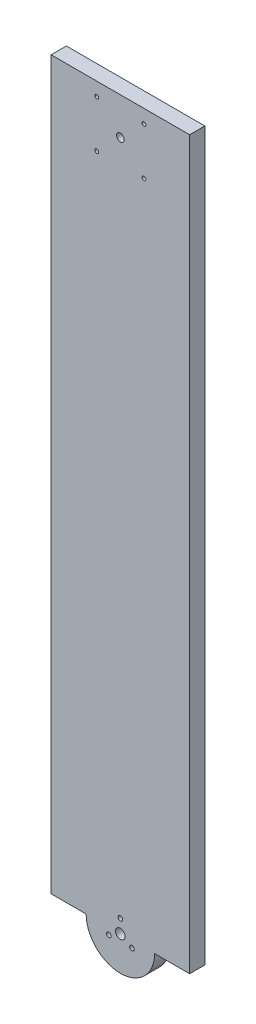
from build123d import *

# Parameters (mm, degrees)
SKETCH1_R           = 1.25
SKETCH1_R_2         = 2.5
SKETCH1_R_3         = 1.5
SKETCH1_R_4         = 3.15
BOSS_EXTRUDE1_DEPTH = 10
SKETCH2_W           = 10
SKETCH2_H           = 477.5
BOSS_EXTRUDE2_DEPTH = 23
SKETCH3_W           = 10
SKETCH3_H           = 477.5
BOSS_EXTRUDE3_DEPTH = 23


with BuildPart() as part:
    # Sketch1 → Boss-Extrude1 (new body)
    with BuildSketch(Plane.XY):
        with BuildLine():
            Line((-22.5, 130), (22.5, 130))
            Line((22.5, 130), (22.5, -347.5))
            ThreePointArc((22.5, -347.5), (0, -370), (-22.5, -347.5))
            Line((-22.5, -347.5), (-22.5, 130))
        make_face()
        with Locations((-15.5, 121.163920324)):
            Circle(SKETCH1_R, mode=Mode.SUBTRACT)
        with Locations(Location((15.5, 121.163920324, 0), (0, 0, 180))):
            Circle(SKETCH1_R, mode=Mode.SUBTRACT)
        with Locations((15.5, 90.163920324)):
            Circle(SKETCH1_R, mode=Mode.SUBTRACT)
        with Locations(Location((-15.5, 90.163920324, 0), (0, 0, 180))):
            Circle(SKETCH1_R, mode=Mode.SUBTRACT)
        with Locations((0, 105.663920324)):
            Circle(SKETCH1_R_2, mode=Mode.SUBTRACT)
        with Locations((0, -338.75)):
            Circle(SKETCH1_R_3, mode=Mode.SUBTRACT)
        with Locations((7.577722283, -351.875)):
            Circle(SKETCH1_R_3, mode=Mode.SUBTRACT)
        with Locations((-7.577722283, -351.875)):
            Circle(SKETCH1_R_3, mode=Mode.SUBTRACT)
        with Locations((0, -347.5)):
            Circle(SKETCH1_R_4, mode=Mode.SUBTRACT)
    extrude(amount=BOSS_EXTRUDE1_DEPTH)

    # Sketch2 → Boss-Extrude2 (add)
    with BuildSketch(Plane(origin=(22.5, 0, 0), x_dir=(0, 0, -1), z_dir=(1, 0, 0))):
        with Locations((-5, -108.75)):
            Rectangle(SKETCH2_W, SKETCH2_H)
    extrude(amount=BOSS_EXTRUDE2_DEPTH)

    # Sketch3 → Boss-Extrude3 (add)
    with BuildSketch(Plane.ZY.offset(22.5)):
        with Locations((5, -108.75)):
            Rectangle(SKETCH3_W, SKETCH3_H)
    extrude(amount=BOSS_EXTRUDE3_DEPTH)


solid = part.part
